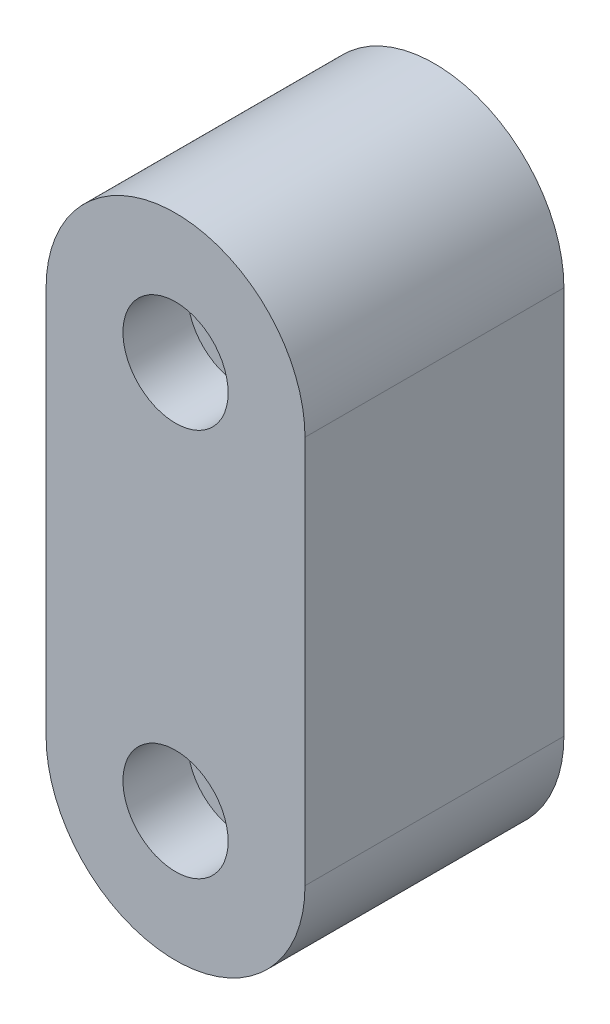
from build123d import *

# Parameters (mm, degrees)
DODANIE_WYCI_GNI_CIE1_DEPTH                         = 16
POG_BIENIE_WALCOWE_POD_M3_WKR_T_Z_BEM_W_D           = 3.4
POG_BIENIE_WALCOWE_POD_M3_WKR_T_Z_BEM_W_CBORE_D     = 6.5
POG_BIENIE_WALCOWE_POD_M3_WKR_T_Z_BEM_W_CBORE_DEPTH = 4


with BuildPart() as part:
    # Szkic1 → Dodanie-wyci_gni_cie1 (new body)
    with BuildSketch(Plane.XY):
        with BuildLine():
            Line((8, 16), (8, -8))
            ThreePointArc((8, -8), (0, -16), (-8, -8))
            Line((-8, -8), (-8, 16))
            ThreePointArc((-8, 16), (0, 24), (8, 16))
        make_face()
    extrude(amount=DODANIE_WYCI_GNI_CIE1_DEPTH)

    # Pog_bienie walcowe pod M3 Wkr_t z _bem w (through all)
    with Locations(Plane(origin=(0, -40.101102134, 16), x_dir=(0, 1, 0), z_dir=(0, 0, 1))):
        with Locations((56.101102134, 0), (32.101102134, 0)):
            CounterBoreHole(POG_BIENIE_WALCOWE_POD_M3_WKR_T_Z_BEM_W_D / 2, POG_BIENIE_WALCOWE_POD_M3_WKR_T_Z_BEM_W_CBORE_D / 2, POG_BIENIE_WALCOWE_POD_M3_WKR_T_Z_BEM_W_CBORE_DEPTH)


solid = part.part
